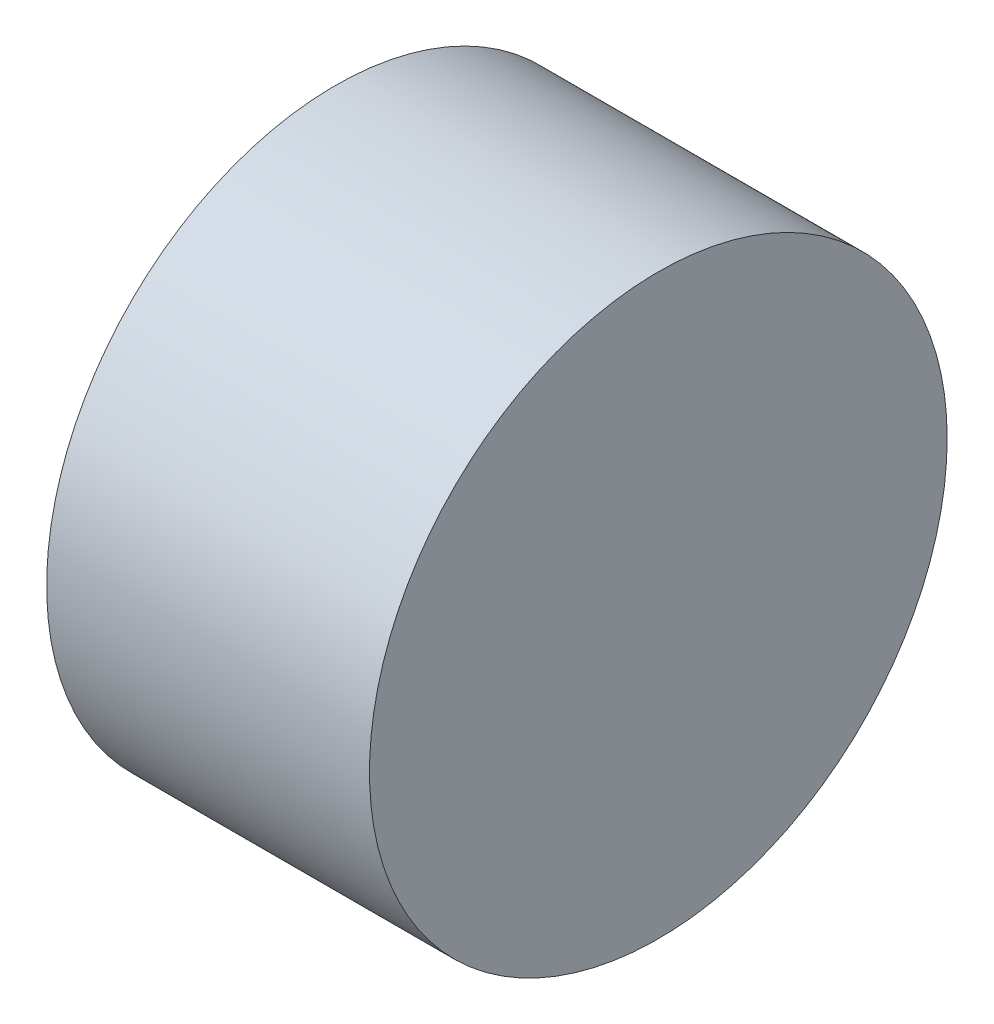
ISO-10303-21;
HEADER;
FILE_DESCRIPTION(('STEP AP214'),'2;1');
FILE_NAME('part.step','',(''),(''),'','','');
FILE_SCHEMA(('AUTOMOTIVE_DESIGN { 1 0 10303 214 1 1 1 1 }'));
ENDSEC;
DATA;
#1=APPLICATION_CONTEXT('core data for automotive mechanical design processes');
#2=APPLICATION_PROTOCOL_DEFINITION('international standard','automotive_design',2000,#1);
#3=PRODUCT_CONTEXT('',#1,'mechanical');
#4=PRODUCT('Part','Part','',(#3));
#5=PRODUCT_RELATED_PRODUCT_CATEGORY('part','',(#4));
#6=PRODUCT_DEFINITION_FORMATION('','',#4);
#7=PRODUCT_DEFINITION_CONTEXT('part definition',#1,'design');
#8=PRODUCT_DEFINITION('design','',#6,#7);
#9=PRODUCT_DEFINITION_SHAPE('','',#8);
#10=(LENGTH_UNIT() NAMED_UNIT(*) SI_UNIT(.MILLI.,.METRE.));
#11=(NAMED_UNIT(*) PLANE_ANGLE_UNIT() SI_UNIT($,.RADIAN.));
#12=(NAMED_UNIT(*) SI_UNIT($,.STERADIAN.) SOLID_ANGLE_UNIT());
#13=UNCERTAINTY_MEASURE_WITH_UNIT(LENGTH_MEASURE(1.E-05),#10,'distance_accuracy_value','');
#14=(GEOMETRIC_REPRESENTATION_CONTEXT(3) GLOBAL_UNCERTAINTY_ASSIGNED_CONTEXT((#13)) GLOBAL_UNIT_ASSIGNED_CONTEXT((#10,
#11,#12)) REPRESENTATION_CONTEXT('',''));
#15=CARTESIAN_POINT('',(0.,0.,0.));
#16=DIRECTION('',(0.,0.,1.));
#17=DIRECTION('',(1.,0.,0.));
#18=AXIS2_PLACEMENT_3D('',#15,#16,#17);
#19=CARTESIAN_POINT('',(312.,102.25,0.));
#20=DIRECTION('',(1.,0.,0.));
#21=DIRECTION('',(0.,0.,-1.));
#22=AXIS2_PLACEMENT_3D('',#19,#20,#21);
#23=PLANE('',#22);
#24=DIRECTION('',(0.,-0.500000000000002,0.866025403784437));
#25=VECTOR('',#24,1.);
#26=CARTESIAN_POINT('',(312.,99.6519237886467,-1.5));
#27=LINE('',#26,#25);
#28=CARTESIAN_POINT('',(312.,98.7858983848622,0.));
#29=VERTEX_POINT('',#28);
#30=CARTESIAN_POINT('',(312.,100.517949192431,-3.00000000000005));
#31=VERTEX_POINT('',#30);
#32=EDGE_CURVE('E80',#29,#31,#27,.F.);
#33=ORIENTED_EDGE('',*,*,#32,.F.);
#34=DIRECTION('',(0.,0.500000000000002,0.866025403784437));
#35=VECTOR('',#34,1.);
#36=CARTESIAN_POINT('',(312.,99.6519237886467,1.49999999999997));
#37=LINE('',#36,#35);
#38=CARTESIAN_POINT('',(312.,100.517949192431,2.99999999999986));
#39=VERTEX_POINT('',#38);
#40=EDGE_CURVE('E60',#39,#29,#37,.F.);
#41=ORIENTED_EDGE('',*,*,#40,.F.);
#42=DIRECTION('',(0.,1.,0.));
#43=VECTOR('',#42,1.);
#44=CARTESIAN_POINT('',(312.,102.25,2.99999999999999));
#45=LINE('',#44,#43);
#46=CARTESIAN_POINT('',(312.,103.982050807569,2.99999999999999));
#47=VERTEX_POINT('',#46);
#48=EDGE_CURVE('E105',#47,#39,#45,.F.);
#49=ORIENTED_EDGE('',*,*,#48,.F.);
#50=DIRECTION('',(0.,0.500000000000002,-0.866025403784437));
#51=VECTOR('',#50,1.);
#52=CARTESIAN_POINT('',(312.,104.848076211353,1.5));
#53=LINE('',#52,#51);
#54=CARTESIAN_POINT('',(312.,105.714101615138,0.));
#55=VERTEX_POINT('',#54);
#56=EDGE_CURVE('E100',#55,#47,#53,.F.);
#57=ORIENTED_EDGE('',*,*,#56,.F.);
#58=DIRECTION('',(0.,-0.500000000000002,-0.866025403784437));
#59=VECTOR('',#58,1.);
#60=CARTESIAN_POINT('',(312.,104.848076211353,-1.5));
#61=LINE('',#60,#59);
#62=CARTESIAN_POINT('',(312.,103.982050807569,-3.00000000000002));
#63=VERTEX_POINT('',#62);
#64=EDGE_CURVE('E95',#63,#55,#61,.F.);
#65=ORIENTED_EDGE('',*,*,#64,.F.);
#66=DIRECTION('',(0.,1.,0.));
#67=VECTOR('',#66,1.);
#68=CARTESIAN_POINT('',(312.,102.25,-3.00000000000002));
#69=LINE('',#68,#67);
#70=EDGE_CURVE('E82',#31,#63,#69,.T.);
#71=ORIENTED_EDGE('',*,*,#70,.F.);
#72=EDGE_LOOP('',(#33,#41,#49,#57,#65,#71));
#73=FACE_BOUND('',#72,.T.);
#74=ADVANCED_FACE('F16',(#73),#23,.F.);
#75=CARTESIAN_POINT('',(309.75,99.6519237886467,1.49999999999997));
#76=DIRECTION('',(0.,0.866025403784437,-0.500000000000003));
#77=DIRECTION('',(0.,0.500000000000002,0.866025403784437));
#78=AXIS2_PLACEMENT_3D('',#75,#76,#77);
#79=PLANE('',#78);
#80=DIRECTION('',(1.,0.,0.));
#81=VECTOR('',#80,1.);
#82=CARTESIAN_POINT('',(309.75,98.7858983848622,0.));
#83=LINE('',#82,#81);
#84=CARTESIAN_POINT('',(307.5,98.7858983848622,0.));
#85=VERTEX_POINT('',#84);
#86=EDGE_CURVE('E74',#85,#29,#83,.T.);
#87=ORIENTED_EDGE('',*,*,#86,.F.);
#88=DIRECTION('',(0.,-0.499999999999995,-0.866025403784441));
#89=VECTOR('',#88,1.);
#90=CARTESIAN_POINT('',(307.5,100.517949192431,2.99999999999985));
#91=LINE('',#90,#89);
#92=CARTESIAN_POINT('',(307.5,100.517949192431,2.99999999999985));
#93=VERTEX_POINT('',#92);
#94=EDGE_CURVE('E53',#93,#85,#91,.T.);
#95=ORIENTED_EDGE('',*,*,#94,.F.);
#96=DIRECTION('',(-1.,0.,0.));
#97=VECTOR('',#96,1.);
#98=CARTESIAN_POINT('',(309.75,100.517949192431,2.99999999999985));
#99=LINE('',#98,#97);
#100=EDGE_CURVE('E76',#39,#93,#99,.T.);
#101=ORIENTED_EDGE('',*,*,#100,.F.);
#102=ORIENTED_EDGE('',*,*,#40,.T.);
#103=EDGE_LOOP('',(#87,#95,#101,#102));
#104=FACE_BOUND('',#103,.T.);
#105=ADVANCED_FACE('F72',(#104),#79,.T.);
#106=CARTESIAN_POINT('',(309.75,99.6519237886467,-1.50000000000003));
#107=DIRECTION('',(0.,0.866025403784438,0.500000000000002));
#108=DIRECTION('',(0.,-0.500000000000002,0.866025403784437));
#109=AXIS2_PLACEMENT_3D('',#106,#107,#108);
#110=PLANE('',#109);
#111=DIRECTION('',(1.,0.,0.));
#112=VECTOR('',#111,1.);
#113=CARTESIAN_POINT('',(309.75,100.517949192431,-3.00000000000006));
#114=LINE('',#113,#112);
#115=CARTESIAN_POINT('',(307.5,100.517949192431,-3.00000000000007));
#116=VERTEX_POINT('',#115);
#117=EDGE_CURVE('E85',#116,#31,#114,.T.);
#118=ORIENTED_EDGE('',*,*,#117,.F.);
#119=DIRECTION('',(0.,0.499999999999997,-0.866025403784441));
#120=VECTOR('',#119,1.);
#121=CARTESIAN_POINT('',(307.5,98.7858983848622,0.));
#122=LINE('',#121,#120);
#123=EDGE_CURVE('E89',#85,#116,#122,.T.);
#124=ORIENTED_EDGE('',*,*,#123,.F.);
#125=ORIENTED_EDGE('',*,*,#86,.T.);
#126=ORIENTED_EDGE('',*,*,#32,.T.);
#127=EDGE_LOOP('',(#118,#124,#125,#126));
#128=FACE_BOUND('',#127,.T.);
#129=ADVANCED_FACE('F87',(#128),#110,.T.);
#130=CARTESIAN_POINT('',(309.75,102.25,-3.00000000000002));
#131=DIRECTION('',(0.,0.,1.));
#132=DIRECTION('',(1.,0.,0.));
#133=AXIS2_PLACEMENT_3D('',#130,#131,#132);
#134=PLANE('',#133);
#135=DIRECTION('',(1.,0.,0.));
#136=VECTOR('',#135,1.);
#137=CARTESIAN_POINT('',(309.75,103.982050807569,-3.00000000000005));
#138=LINE('',#137,#136);
#139=CARTESIAN_POINT('',(307.5,103.982050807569,-3.00000000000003));
#140=VERTEX_POINT('',#139);
#141=EDGE_CURVE('E93',#140,#63,#138,.T.);
#142=ORIENTED_EDGE('',*,*,#141,.F.);
#143=DIRECTION('',(0.,1.,0.));
#144=VECTOR('',#143,1.);
#145=CARTESIAN_POINT('',(307.5,102.25,-3.00000000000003));
#146=LINE('',#145,#144);
#147=EDGE_CURVE('E117',#116,#140,#146,.T.);
#148=ORIENTED_EDGE('',*,*,#147,.F.);
#149=ORIENTED_EDGE('',*,*,#117,.T.);
#150=ORIENTED_EDGE('',*,*,#70,.T.);
#151=EDGE_LOOP('',(#142,#148,#149,#150));
#152=FACE_BOUND('',#151,.T.);
#153=ADVANCED_FACE('F132',(#152),#134,.T.);
#154=CARTESIAN_POINT('',(309.75,104.848076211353,-1.50000000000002));
#155=DIRECTION('',(0.,-0.866025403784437,0.500000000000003));
#156=DIRECTION('',(0.,-0.500000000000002,-0.866025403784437));
#157=AXIS2_PLACEMENT_3D('',#154,#155,#156);
#158=PLANE('',#157);
#159=DIRECTION('',(1.,0.,0.));
#160=VECTOR('',#159,1.);
#161=CARTESIAN_POINT('',(309.75,105.714101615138,0.));
#162=LINE('',#161,#160);
#163=CARTESIAN_POINT('',(307.5,105.714101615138,0.));
#164=VERTEX_POINT('',#163);
#165=EDGE_CURVE('E97',#164,#55,#162,.T.);
#166=ORIENTED_EDGE('',*,*,#165,.F.);
#167=DIRECTION('',(0.,0.499999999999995,0.866025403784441));
#168=VECTOR('',#167,1.);
#169=CARTESIAN_POINT('',(307.5,103.982050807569,-3.00000000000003));
#170=LINE('',#169,#168);
#171=EDGE_CURVE('E114',#140,#164,#170,.T.);
#172=ORIENTED_EDGE('',*,*,#171,.F.);
#173=ORIENTED_EDGE('',*,*,#141,.T.);
#174=ORIENTED_EDGE('',*,*,#64,.T.);
#175=EDGE_LOOP('',(#166,#172,#173,#174));
#176=FACE_BOUND('',#175,.T.);
#177=ADVANCED_FACE('F129',(#176),#158,.T.);
#178=CARTESIAN_POINT('',(309.75,104.848076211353,1.49999999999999));
#179=DIRECTION('',(0.,-0.866025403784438,-0.500000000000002));
#180=DIRECTION('',(0.,0.500000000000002,-0.866025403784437));
#181=AXIS2_PLACEMENT_3D('',#178,#179,#180);
#182=PLANE('',#181);
#183=DIRECTION('',(-1.,0.,0.));
#184=VECTOR('',#183,1.);
#185=CARTESIAN_POINT('',(309.75,103.982050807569,2.99999999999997));
#186=LINE('',#185,#184);
#187=CARTESIAN_POINT('',(307.5,103.982050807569,2.99999999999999));
#188=VERTEX_POINT('',#187);
#189=EDGE_CURVE('E33',#188,#47,#186,.F.);
#190=ORIENTED_EDGE('',*,*,#189,.F.);
#191=DIRECTION('',(0.,-0.499999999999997,0.866025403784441));
#192=VECTOR('',#191,1.);
#193=CARTESIAN_POINT('',(307.5,105.714101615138,0.));
#194=LINE('',#193,#192);
#195=EDGE_CURVE('E111',#164,#188,#194,.T.);
#196=ORIENTED_EDGE('',*,*,#195,.F.);
#197=ORIENTED_EDGE('',*,*,#165,.T.);
#198=ORIENTED_EDGE('',*,*,#56,.T.);
#199=EDGE_LOOP('',(#190,#196,#197,#198));
#200=FACE_BOUND('',#199,.T.);
#201=ADVANCED_FACE('F126',(#200),#182,.T.);
#202=CARTESIAN_POINT('',(309.75,102.25,2.99999999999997));
#203=DIRECTION('',(0.,0.,-1.));
#204=DIRECTION('',(-1.,0.,0.));
#205=AXIS2_PLACEMENT_3D('',#202,#203,#204);
#206=PLANE('',#205);
#207=ORIENTED_EDGE('',*,*,#100,.T.);
#208=DIRECTION('',(0.,1.,0.));
#209=VECTOR('',#208,1.);
#210=CARTESIAN_POINT('',(307.5,102.25,2.99999999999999));
#211=LINE('',#210,#209);
#212=EDGE_CURVE('E108',#188,#93,#211,.F.);
#213=ORIENTED_EDGE('',*,*,#212,.F.);
#214=ORIENTED_EDGE('',*,*,#189,.T.);
#215=ORIENTED_EDGE('',*,*,#48,.T.);
#216=EDGE_LOOP('',(#207,#213,#214,#215));
#217=FACE_BOUND('',#216,.T.);
#218=ADVANCED_FACE('F124',(#217),#206,.T.);
#219=CARTESIAN_POINT('',(307.5,102.25,0.));
#220=DIRECTION('',(-1.,0.,0.));
#221=DIRECTION('',(0.,0.,1.));
#222=AXIS2_PLACEMENT_3D('',#219,#220,#221);
#223=PLANE('',#222);
#224=CARTESIAN_POINT('',(307.5,102.25,0.));
#225=DIRECTION('',(1.,0.,0.));
#226=DIRECTION('',(0.,0.,-1.));
#227=AXIS2_PLACEMENT_3D('',#224,#225,#226);
#228=CIRCLE('',#227,8.5);
#229=CARTESIAN_POINT('',(307.5,102.25,-8.50000000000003));
#230=VERTEX_POINT('',#229);
#231=EDGE_CURVE('E20',#230,#230,#228,.T.);
#232=ORIENTED_EDGE('',*,*,#231,.F.);
#233=EDGE_LOOP('',(#232));
#234=FACE_BOUND('',#233,.T.);
#235=ORIENTED_EDGE('',*,*,#195,.T.);
#236=ORIENTED_EDGE('',*,*,#212,.T.);
#237=ORIENTED_EDGE('',*,*,#94,.T.);
#238=ORIENTED_EDGE('',*,*,#123,.T.);
#239=ORIENTED_EDGE('',*,*,#147,.T.);
#240=ORIENTED_EDGE('',*,*,#171,.T.);
#241=EDGE_LOOP('',(#235,#236,#237,#238,#239,#240));
#242=FACE_BOUND('',#241,.T.);
#243=ADVANCED_FACE('F122',(#234,#242),#223,.T.);
#244=CARTESIAN_POINT('',(317.,102.25,0.));
#245=DIRECTION('',(1.,0.,0.));
#246=DIRECTION('',(0.,0.,-1.));
#247=AXIS2_PLACEMENT_3D('',#244,#245,#246);
#248=PLANE('',#247);
#249=CARTESIAN_POINT('',(317.,102.25,0.));
#250=DIRECTION('',(1.,0.,0.));
#251=DIRECTION('',(0.,0.,-1.));
#252=AXIS2_PLACEMENT_3D('',#249,#250,#251);
#253=CIRCLE('',#252,8.5);
#254=CARTESIAN_POINT('',(317.,102.25,-8.50000000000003));
#255=VERTEX_POINT('',#254);
#256=EDGE_CURVE('E11',#255,#255,#253,.F.);
#257=ORIENTED_EDGE('',*,*,#256,.F.);
#258=EDGE_LOOP('',(#257));
#259=FACE_BOUND('',#258,.T.);
#260=ADVANCED_FACE('F143',(#259),#248,.T.);
#261=CARTESIAN_POINT('',(312.25,102.25,0.));
#262=DIRECTION('',(1.,0.,0.));
#263=DIRECTION('',(0.,0.,-1.));
#264=AXIS2_PLACEMENT_3D('',#261,#262,#263);
#265=CYLINDRICAL_SURFACE('',#264,8.5);
#266=ORIENTED_EDGE('',*,*,#231,.T.);
#267=EDGE_LOOP('',(#266));
#268=FACE_BOUND('',#267,.T.);
#269=ORIENTED_EDGE('',*,*,#256,.T.);
#270=EDGE_LOOP('',(#269));
#271=FACE_BOUND('',#270,.T.);
#272=ADVANCED_FACE('F18',(#268,#271),#265,.T.);
#273=CLOSED_SHELL('',(#74,#105,#129,#153,#177,#201,#218,#243,#260,#272));
#274=MANIFOLD_SOLID_BREP('B1',#273);
#275=ADVANCED_BREP_SHAPE_REPRESENTATION('',(#18,#274),#14);
#276=SHAPE_DEFINITION_REPRESENTATION(#9,#275);
ENDSEC;
END-ISO-10303-21;
